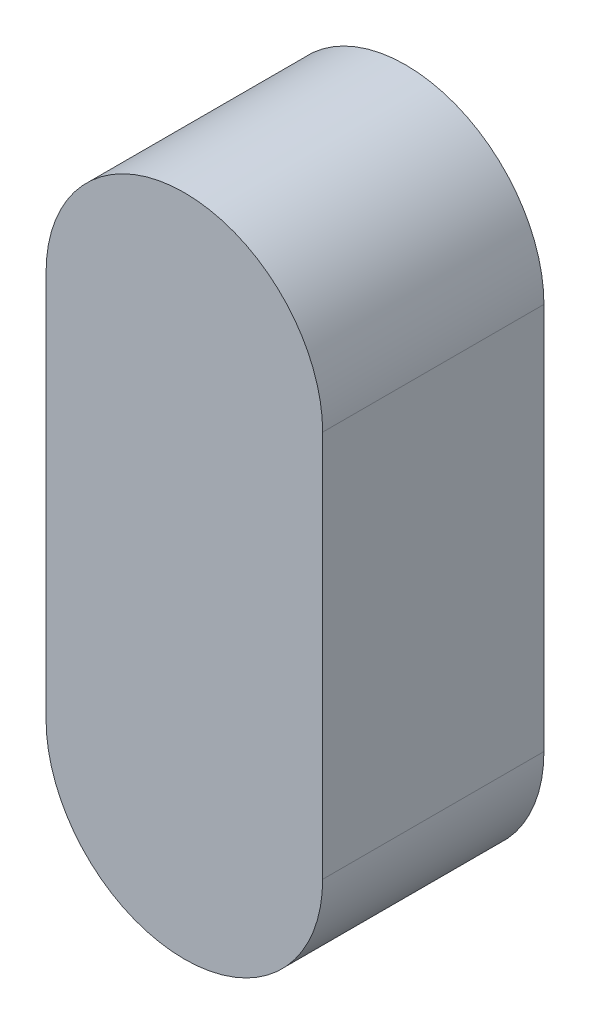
from build123d import *

# Parameters (mm, degrees)
EXTRUDE_1_DEPTH = 4


with BuildPart() as part:
    # Sketch 1 → Extrude 1 (new body)
    with BuildSketch(Plane.XY):
        with BuildLine():
            Line((7, -93.5), (7, -86.5))
            ThreePointArc((7, -86.5), (4.5, -84), (2, -86.5))
            Line((2, -86.5), (2, -93.5))
            ThreePointArc((2, -93.5), (4.5, -96), (7, -93.5))
        make_face()
    extrude(amount=EXTRUDE_1_DEPTH)


solid = part.part
